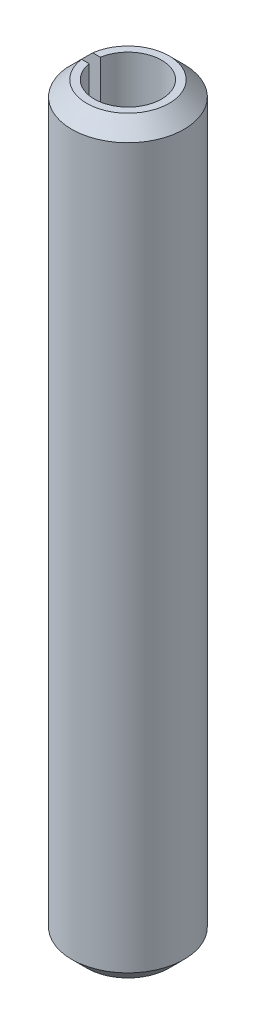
from build123d import *

# Parameters (mm, degrees)
ESQUISSE1_W                  = 1.2
ESQUISSE1_H                  = 40
CHANFREIN1_SIZE              = 0.8
ENL_V_MAT_EXTRU_1_DEPTH      = 21.4450483
ENL_V_MAT_EXTRU_1_DEPTH_BACK = 21.4450483
ESQUISSE2_W                  = 3
ESQUISSE2_H                  = 0.6


with BuildPart() as part:
    # Esquisse1 → Base-R_volution (revolve)
    with BuildSketch(Plane.XY, mode=Mode.PRIVATE) as base_r_volution_sk:
        with Locations((2.4, 0)):
            Rectangle(ESQUISSE1_W, ESQUISSE1_H)
    revolve(base_r_volution_sk.sketch.rotate(Axis((0, 20, 0), (0, -1, 0)), 90), axis=Axis((0, 20, 0), (0, -1, 0)))

    # Chanfrein1
    chanfrein1_edges = [part.edges().sort_by_distance(p)[0] for p in [
        (0, -20, -3),
        (0, 20, -3),
    ]]
    chamfer(chanfrein1_edges, length=CHANFREIN1_SIZE)

    # Esquisse2 → Enl_v. mat.-Extru.1 (cut, two sides: drawn at the far end of the back side and taken through both)
    with BuildSketch(Plane(origin=(0, 0, 0), x_dir=(-1, 0, 0), z_dir=(0, 1, 0)).offset(-ENL_V_MAT_EXTRU_1_DEPTH_BACK)):
        with Locations((1.5, 0)):
            Rectangle(ESQUISSE2_W, ESQUISSE2_H)
    extrude(amount=ENL_V_MAT_EXTRU_1_DEPTH + ENL_V_MAT_EXTRU_1_DEPTH_BACK, mode=Mode.SUBTRACT)


solid = part.part
